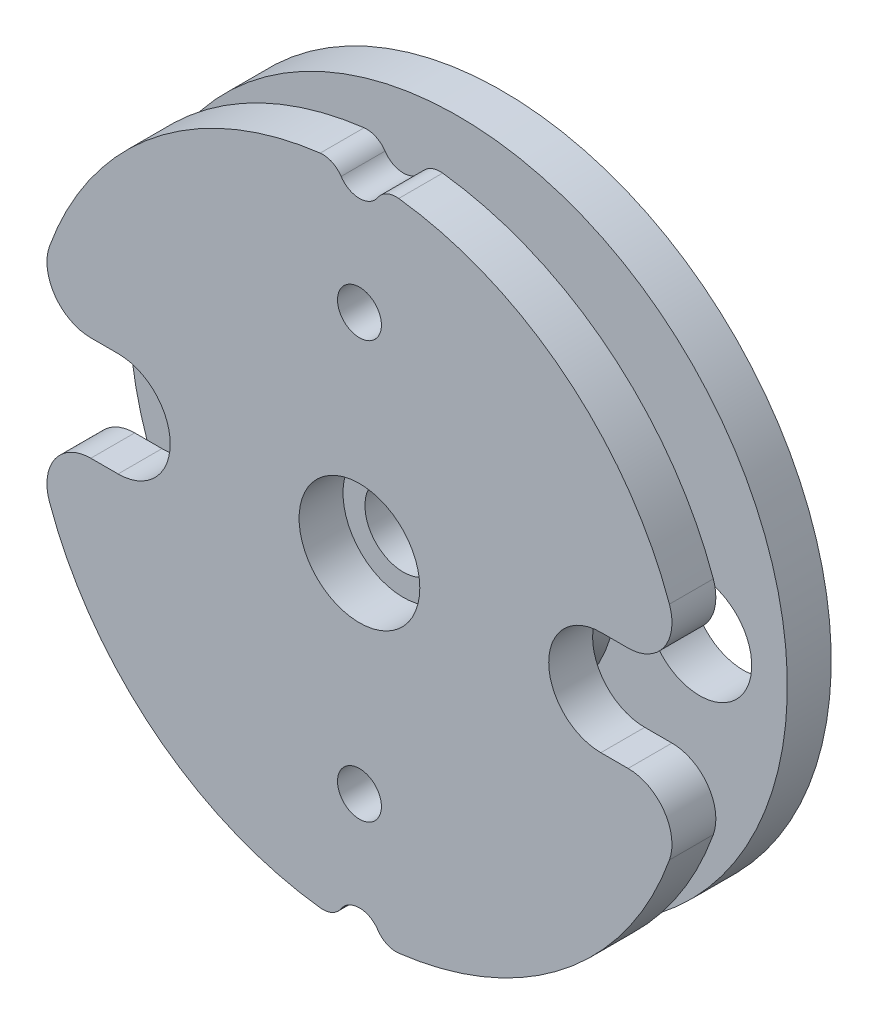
from build123d import *

# Parameters (mm, degrees)
SKETCH1_R                       = 15
BODY_DEPTH                      = 3.25
SKETCH2_R                       = 15
SKETCH2_R_2                     = 6.5
PULLEY_CLEARANCE_DEPTH          = 1.25
SKETCH3_R                       = 1.75
MAIN_BOLT_THROUGH_HOLE_DEPTH    = 23.186707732
SKETCH4_R                       = 5.25
SERVO_HORN_CLEARANCE_DEPTH      = 1.8
SKETCH5_R                       = 2.75
MAIN_BOLT_CLEARANCE_DEPTH       = 2
SKETCH6_R                       = 2.375
HORN_ATTACHMENT_HOLES_DEPTH     = 23.186707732
HORN_ATTACHMENT_CLEARANCE_DEPTH = 2
SKETCH8_R                       = 1
TENDON_ANCHOR_DEPTH             = 2
CONTOURING_1_R                  = 2
INNER_CHAMFER_SIZE              = 0.75
CONTOURING_2_R                  = 1


with BuildPart() as part:
    # Sketch1 → Body (new, symmetric)
    with BuildSketch(Plane.XY):
        with Locations(Location((0, 0, 0), (0, 0, 180))):
            Circle(SKETCH1_R)
    extrude(amount=BODY_DEPTH, both=True)

    # Sketch2 → Pulley Clearance (cut, symmetric)
    with BuildSketch(Plane.XY):
        with Locations(Location((0, 0, 0), (0, 0, 180))):
            Circle(SKETCH2_R)
        Circle(SKETCH2_R_2, mode=Mode.SUBTRACT)
    extrude(amount=PULLEY_CLEARANCE_DEPTH, both=True, mode=Mode.SUBTRACT)

    # Sketch3 → Main Bolt Through Hole (cut, through all)
    with BuildSketch(Plane.XY.offset(3.25)):
        Circle(SKETCH3_R)
    extrude(amount=-MAIN_BOLT_THROUGH_HOLE_DEPTH, mode=Mode.SUBTRACT)

    # Sketch4 → Servo Horn Clearance (cut)
    with BuildSketch(Plane(origin=(0, 0, -3.25), x_dir=(-1, 0, 0), z_dir=(0, 0, -1))):
        Circle(SKETCH4_R)
    extrude(amount=-SERVO_HORN_CLEARANCE_DEPTH, mode=Mode.SUBTRACT)

    # Sketch5 → Main Bolt Clearance (cut)
    with BuildSketch(Plane.XY.offset(3.25)):
        Circle(SKETCH5_R)
    extrude(amount=-MAIN_BOLT_CLEARANCE_DEPTH, mode=Mode.SUBTRACT)

    # Sketch6 → Horn Attachment Holes (cut, through all)
    with BuildSketch(Plane(origin=(0, 0, -3.25), x_dir=(-1, 0, 0), z_dir=(0, 0, -1))):
        with Locations((-11, 0)):
            Circle(SKETCH6_R)
        with Locations((11, 0)):
            Circle(SKETCH6_R)
    extrude(amount=-HORN_ATTACHMENT_HOLES_DEPTH, mode=Mode.SUBTRACT)

    # Sketch7 → Horn Attachment Clearance (cut)
    with BuildSketch(Plane.XY.offset(3.25)):
        with BuildLine():
            Line((11, -2.375), (11, 2.375))
            Line((11, 2.375), (14.810785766, 2.375))
            ThreePointArc((14.810785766, 2.375), (15, 0), (14.810785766, -2.375))
            Line((14.810785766, -2.375), (11, -2.375))
        make_face()
        with BuildLine():
            Line((-11, -2.375), (-14.810785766, -2.375))
            ThreePointArc((-14.810785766, -2.375), (-15, 0), (-14.810785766, 2.375))
            Line((-14.810785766, 2.375), (-11, 2.375))
            Line((-11, 2.375), (-11, -2.375))
        make_face()
    extrude(amount=-HORN_ATTACHMENT_CLEARANCE_DEPTH, mode=Mode.SUBTRACT)

    # Sketch8 → Tendon Anchor (cut)
    with BuildSketch(Plane.XY.offset(3.25)):
        with Locations((0, 9.5)):
            Circle(SKETCH8_R)
        with Locations((0, 15)):
            Circle(SKETCH8_R)
        with Locations((0, -15)):
            Circle(SKETCH8_R)
        with Locations((0, -9.5)):
            Circle(SKETCH8_R)
    extrude(amount=-TENDON_ANCHOR_DEPTH, mode=Mode.SUBTRACT)

    # Contouring 1
    contouring_1_edges = [part.edges().sort_by_distance(p)[0] for p in [
        (14.810785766, -2.375, 2.25),
        (14.810785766, 2.375, 2.25),
        (-14.810785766, -2.375, 2.25),
        (-14.810785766, 2.375, 2.25),
    ]]
    fillet(contouring_1_edges, radius=CONTOURING_1_R)

    # Inner Chamfer
    inner_chamfer_edges = [part.edges().sort_by_distance(p)[0] for p in [
        (-6.5, 0, -1.25),
        (-6.5, 0, 1.25),
    ]]
    chamfer(inner_chamfer_edges, length=INNER_CHAMFER_SIZE)

    # Contouring 2
    contouring_2_edges = [part.edges().sort_by_distance(p)[0] for p in [
        (0.99944429, -14.966666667, 2.25),
        (-0.99944429, -14.966666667, 2.25),
        (0.99944429, 14.966666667, 2.25),
        (-0.99944429, 14.966666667, 2.25),
    ]]
    fillet(contouring_2_edges, radius=CONTOURING_2_R)


solid = part.part
